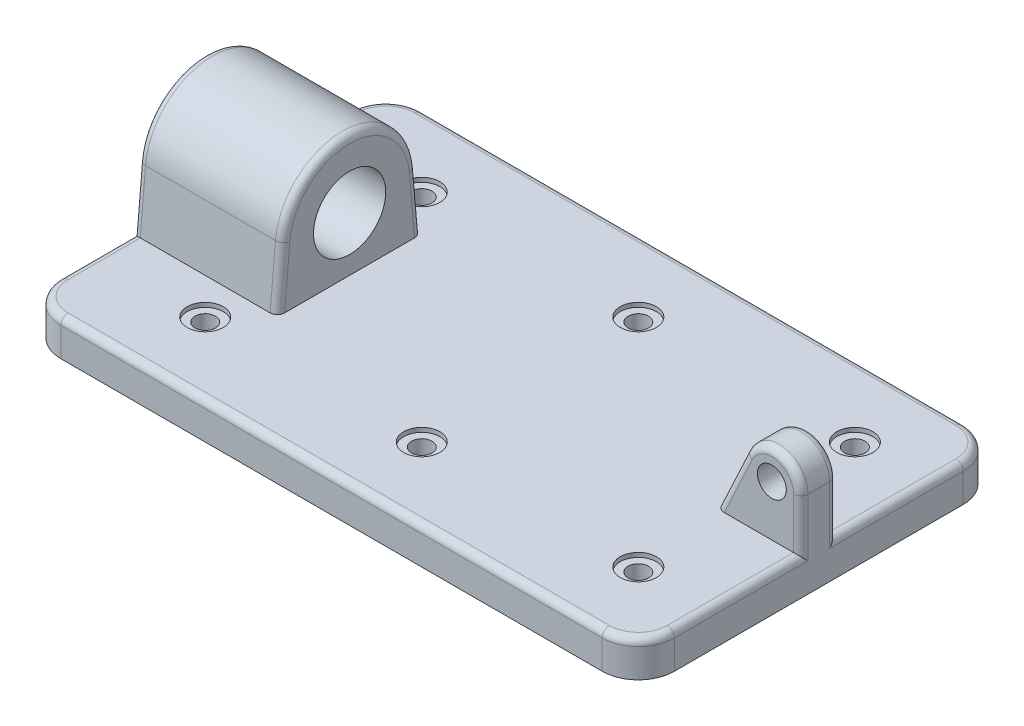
from build123d import *

# Parameters (mm, degrees)
SKETCH1_W                      = 107.95
SKETCH1_H                      = 6.35
BASE_EXTRUDE_DEPTH             = 31.75
LEVER_BOSS_DEPTH               = 3.175
BOSS_EXTRUDE2_DEPTH            = 25.4
FILLET1_R                      = 6.35
HOLE1_D                        = 5.08
HOLE2_D                        = 12.7
HOLE2_DEPTH                    = 25.4
F_4_SPOTFACE_HOLE1_D           = 3.6068
F_4_SPOTFACE_HOLE1_CBORE_D     = 6.35
F_4_SPOTFACE_HOLE1_CBORE_DEPTH = 0.762
LPATTERN1_COUNT                = 3
LPATTERN1_PITCH                = 38.1
LPATTERN1_COUNT_DIR2           = 2
LPATTERN1_PITCH_DIR2           = 38.1
FILLET2_R                      = 1.27


with BuildPart() as part:
    # Sketch1 → Base-Extrude (new, symmetric)
    with BuildSketch(Plane.XY):
        with Locations((53.975, 3.175)):
            Rectangle(SKETCH1_W, SKETCH1_H)
    extrude(amount=BASE_EXTRUDE_DEPTH, both=True)

    # Sketch2 → lever boss (add, symmetric)
    with BuildSketch(Plane.XY):
        with BuildLine():
            Line((107.95, 6.35), (107.95, 15.24))
            ThreePointArc((107.95, 15.24), (103.969513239, 20.199583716), (98.265956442, 17.38690077))
            Line((98.265956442, 17.38690077), (93.119365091, 6.35))
            Line((93.119365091, 6.35), (107.95, 6.35))
        make_face()
    extrude(amount=LEVER_BOSS_DEPTH, both=True)

    # Sketch3 → Boss-Extrude2 (add)
    with BuildSketch(Plane.ZY):
        with BuildLine():
            Line((12.7, 6.35), (11.776529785, 16.905312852))
            ThreePointArc((11.776529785, 16.905312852), (0, 27.696514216), (-11.776529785, 16.905312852))
            Line((-11.776529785, 16.905312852), (-12.7, 6.35))
            Line((-12.7, 6.35), (12.7, 6.35))
        make_face()
    extrude(amount=-BOSS_EXTRUDE2_DEPTH)

    # Fillet1
    fillet1_edges = [part.edges().sort_by_distance(p)[0] for p in [
        (107.95, 3.175, 31.75),
        (0, 3.175, 31.75),
        (107.95, 3.175, -31.75),
        (0, 3.175, -31.75),
    ]]
    fillet(fillet1_edges, radius=FILLET1_R)

    # Hole1 (through all)
    with Locations(Plane.XY.offset(3.175)):
        with Locations((102.87, 15.24)):
            Hole(HOLE1_D / 2)

    # Hole2
    with Locations(Plane(origin=(25.4, 3.190032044, 95.175064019), x_dir=(0, 0, -1), z_dir=(1, 0, 0))):
        with Locations((95.175064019, 12.684967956)):
            Hole(HOLE2_D / 2, depth=HOLE2_DEPTH)

    # 4 spotface hole1 (through all)
    with Locations(Plane(origin=(72.288522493, 6.35, 6.630777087), x_dir=(-1, 0, 0), z_dir=(0, 1, 0))):
        with Locations((-22.961477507, 12.419222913)):
            f_4_spotface_hole1 = CounterBoreHole(F_4_SPOTFACE_HOLE1_D / 2, F_4_SPOTFACE_HOLE1_CBORE_D / 2, F_4_SPOTFACE_HOLE1_CBORE_DEPTH)

    # LPattern1: 4 spotface hole1 3 × 2
    with Locations(*[(-i * LPATTERN1_PITCH, 0, -j * LPATTERN1_PITCH_DIR2) for i in range(LPATTERN1_COUNT) for j in range(LPATTERN1_COUNT_DIR2) if (i, j) != (0, 0)]):
        add(f_4_spotface_hole1, mode=Mode.SUBTRACT)

    # Fillet2
    fillet2_edges = [part.edges().sort_by_distance(p)[0] for p in [
        (107.95, 6.35, -14.2875),
        (107.95, 10.795, -3.175),
        (103.969513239, 20.199583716, -3.175),
        (95.692660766, 11.868450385, -3.175),
        (107.95, 10.795, 3.175),
        (103.969513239, 20.199583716, 3.175),
        (95.692660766, 11.868450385, 3.175),
        (0, 6.35, 19.05),
        (0, 11.627656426, -12.238264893),
        (0, 27.696514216, 0),
        (25.4, 11.627656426, 12.238264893),
        (25.4, 11.627656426, -12.238264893),
        (25.4, 27.696514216, 0),
        (0, 11.627656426, 12.238264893),
        (53.975, 6.35, -31.75),
        (53.975, 6.35, 31.75),
        (106.090128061, 6.35, -29.890128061),
        (106.090128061, 6.35, 29.890128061),
        (1.859871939, 6.35, 29.890128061),
        (1.859871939, 6.35, -29.890128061),
    ]]
    fillet(fillet2_edges, radius=FILLET2_R)


solid = part.part
